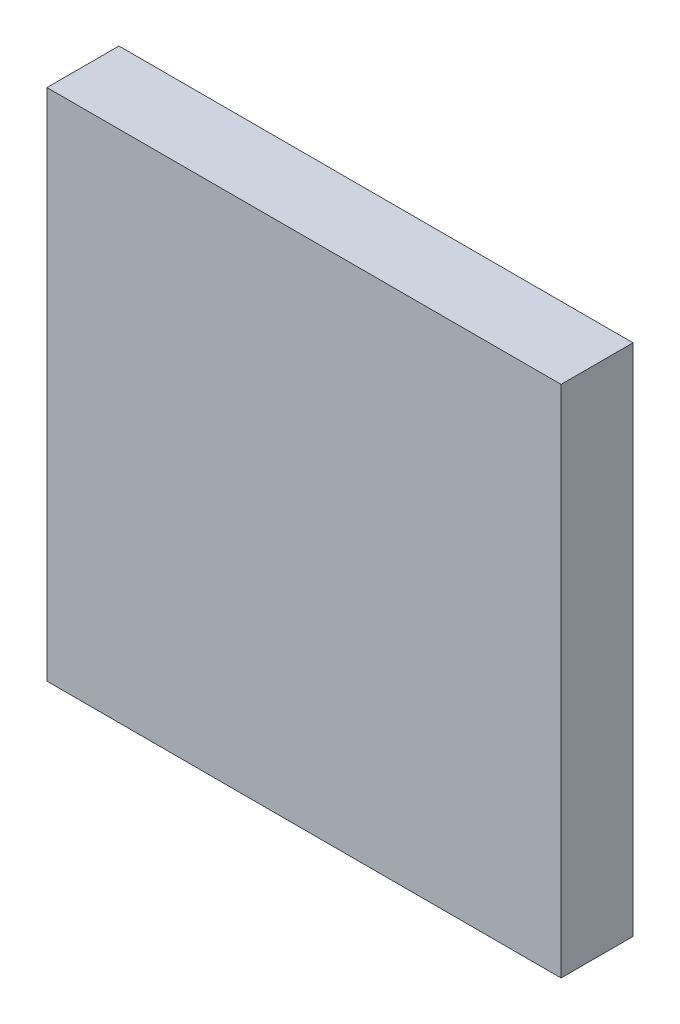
ISO-10303-21;
HEADER;
FILE_DESCRIPTION(('STEP AP214'),'2;1');
FILE_NAME('part.step','',(''),(''),'','','');
FILE_SCHEMA(('AUTOMOTIVE_DESIGN { 1 0 10303 214 1 1 1 1 }'));
ENDSEC;
DATA;
#1=APPLICATION_CONTEXT('core data for automotive mechanical design processes');
#2=APPLICATION_PROTOCOL_DEFINITION('international standard','automotive_design',2000,#1);
#3=PRODUCT_CONTEXT('',#1,'mechanical');
#4=PRODUCT('Part','Part','',(#3));
#5=PRODUCT_RELATED_PRODUCT_CATEGORY('part','',(#4));
#6=PRODUCT_DEFINITION_FORMATION('','',#4);
#7=PRODUCT_DEFINITION_CONTEXT('part definition',#1,'design');
#8=PRODUCT_DEFINITION('design','',#6,#7);
#9=PRODUCT_DEFINITION_SHAPE('','',#8);
#10=(LENGTH_UNIT() NAMED_UNIT(*) SI_UNIT(.MILLI.,.METRE.));
#11=(NAMED_UNIT(*) PLANE_ANGLE_UNIT() SI_UNIT($,.RADIAN.));
#12=(NAMED_UNIT(*) SI_UNIT($,.STERADIAN.) SOLID_ANGLE_UNIT());
#13=UNCERTAINTY_MEASURE_WITH_UNIT(LENGTH_MEASURE(1.E-05),#10,'distance_accuracy_value','');
#14=(GEOMETRIC_REPRESENTATION_CONTEXT(3) GLOBAL_UNCERTAINTY_ASSIGNED_CONTEXT((#13)) GLOBAL_UNIT_ASSIGNED_CONTEXT((#10,
#11,#12)) REPRESENTATION_CONTEXT('',''));
#15=CARTESIAN_POINT('',(0.,0.,0.));
#16=DIRECTION('',(0.,0.,1.));
#17=DIRECTION('',(1.,0.,0.));
#18=AXIS2_PLACEMENT_3D('',#15,#16,#17);
#19=CARTESIAN_POINT('',(-2.50000008,2.50000008,0.70000114));
#20=DIRECTION('',(0.,0.,1.));
#21=DIRECTION('',(1.,0.,0.));
#22=AXIS2_PLACEMENT_3D('',#19,#20,#21);
#23=PLANE('',#22);
#24=DIRECTION('',(0.,1.,0.));
#25=VECTOR('',#24,1.);
#26=CARTESIAN_POINT('',(2.50000008,2.50000008,0.70000114));
#27=LINE('',#26,#25);
#28=CARTESIAN_POINT('',(2.50000008,2.50000008,0.70000114));
#29=VERTEX_POINT('',#28);
#30=CARTESIAN_POINT('',(2.50000008,-2.50000008,0.70000114));
#31=VERTEX_POINT('',#30);
#32=EDGE_CURVE('E52',#29,#31,#27,.F.);
#33=ORIENTED_EDGE('',*,*,#32,.F.);
#34=DIRECTION('',(1.,0.,0.));
#35=VECTOR('',#34,1.);
#36=CARTESIAN_POINT('',(-2.50000008,2.50000008,0.70000114));
#37=LINE('',#36,#35);
#38=CARTESIAN_POINT('',(-2.50000008,2.50000008,0.70000114));
#39=VERTEX_POINT('',#38);
#40=EDGE_CURVE('E67',#39,#29,#37,.T.);
#41=ORIENTED_EDGE('',*,*,#40,.F.);
#42=DIRECTION('',(0.,1.,0.));
#43=VECTOR('',#42,1.);
#44=CARTESIAN_POINT('',(-2.50000008,-2.50000008,0.70000114));
#45=LINE('',#44,#43);
#46=CARTESIAN_POINT('',(-2.50000008,-2.50000008,0.70000114));
#47=VERTEX_POINT('',#46);
#48=EDGE_CURVE('E19',#47,#39,#45,.T.);
#49=ORIENTED_EDGE('',*,*,#48,.F.);
#50=DIRECTION('',(1.,0.,0.));
#51=VECTOR('',#50,1.);
#52=CARTESIAN_POINT('',(2.50000008,-2.50000008,0.70000114));
#53=LINE('',#52,#51);
#54=EDGE_CURVE('E57',#31,#47,#53,.F.);
#55=ORIENTED_EDGE('',*,*,#54,.F.);
#56=EDGE_LOOP('',(#33,#41,#49,#55));
#57=FACE_BOUND('',#56,.T.);
#58=ADVANCED_FACE('F16',(#57),#23,.T.);
#59=CARTESIAN_POINT('',(-2.50000008,-2.50000008,0.));
#60=DIRECTION('',(-1.,0.,0.));
#61=DIRECTION('',(0.,0.,1.));
#62=AXIS2_PLACEMENT_3D('',#59,#60,#61);
#63=PLANE('',#62);
#64=DIRECTION('',(0.,0.,1.));
#65=VECTOR('',#64,1.);
#66=CARTESIAN_POINT('',(-2.50000008,2.50000008,0.));
#67=LINE('',#66,#65);
#68=CARTESIAN_POINT('',(-2.50000008,2.50000008,0.));
#69=VERTEX_POINT('',#68);
#70=EDGE_CURVE('E78',#69,#39,#67,.T.);
#71=ORIENTED_EDGE('',*,*,#70,.F.);
#72=DIRECTION('',(0.,1.,0.));
#73=VECTOR('',#72,1.);
#74=CARTESIAN_POINT('',(-2.50000008,2.50000008,0.));
#75=LINE('',#74,#73);
#76=CARTESIAN_POINT('',(-2.50000008,-2.50000008,0.));
#77=VERTEX_POINT('',#76);
#78=EDGE_CURVE('E73',#69,#77,#75,.F.);
#79=ORIENTED_EDGE('',*,*,#78,.T.);
#80=DIRECTION('',(0.,0.,-1.));
#81=VECTOR('',#80,1.);
#82=CARTESIAN_POINT('',(-2.50000008,-2.50000008,0.));
#83=LINE('',#82,#81);
#84=EDGE_CURVE('E62',#47,#77,#83,.T.);
#85=ORIENTED_EDGE('',*,*,#84,.F.);
#86=ORIENTED_EDGE('',*,*,#48,.T.);
#87=EDGE_LOOP('',(#71,#79,#85,#86));
#88=FACE_BOUND('',#87,.T.);
#89=ADVANCED_FACE('F72',(#88),#63,.T.);
#90=CARTESIAN_POINT('',(2.50000008,-2.50000008,0.));
#91=DIRECTION('',(0.,-1.,0.));
#92=DIRECTION('',(0.,0.,-1.));
#93=AXIS2_PLACEMENT_3D('',#90,#91,#92);
#94=PLANE('',#93);
#95=ORIENTED_EDGE('',*,*,#84,.T.);
#96=DIRECTION('',(1.,0.,0.));
#97=VECTOR('',#96,1.);
#98=CARTESIAN_POINT('',(-2.50000008,-2.50000008,0.));
#99=LINE('',#98,#97);
#100=CARTESIAN_POINT('',(2.50000008,-2.50000008,0.));
#101=VERTEX_POINT('',#100);
#102=EDGE_CURVE('E83',#77,#101,#99,.T.);
#103=ORIENTED_EDGE('',*,*,#102,.T.);
#104=DIRECTION('',(0.,0.,-1.));
#105=VECTOR('',#104,1.);
#106=CARTESIAN_POINT('',(2.50000008,-2.50000008,0.));
#107=LINE('',#106,#105);
#108=EDGE_CURVE('E64',#31,#101,#107,.T.);
#109=ORIENTED_EDGE('',*,*,#108,.F.);
#110=ORIENTED_EDGE('',*,*,#54,.T.);
#111=EDGE_LOOP('',(#95,#103,#109,#110));
#112=FACE_BOUND('',#111,.T.);
#113=ADVANCED_FACE('F59',(#112),#94,.T.);
#114=CARTESIAN_POINT('',(2.50000008,2.50000008,0.));
#115=DIRECTION('',(1.,0.,0.));
#116=DIRECTION('',(0.,0.,-1.));
#117=AXIS2_PLACEMENT_3D('',#114,#115,#116);
#118=PLANE('',#117);
#119=ORIENTED_EDGE('',*,*,#108,.T.);
#120=DIRECTION('',(0.,1.,0.));
#121=VECTOR('',#120,1.);
#122=CARTESIAN_POINT('',(2.50000008,2.50000008,0.));
#123=LINE('',#122,#121);
#124=CARTESIAN_POINT('',(2.50000008,2.50000008,0.));
#125=VERTEX_POINT('',#124);
#126=EDGE_CURVE('E25',#101,#125,#123,.T.);
#127=ORIENTED_EDGE('',*,*,#126,.T.);
#128=DIRECTION('',(0.,0.,1.));
#129=VECTOR('',#128,1.);
#130=CARTESIAN_POINT('',(2.50000008,2.50000008,0.));
#131=LINE('',#130,#129);
#132=EDGE_CURVE('E33',#29,#125,#131,.F.);
#133=ORIENTED_EDGE('',*,*,#132,.F.);
#134=ORIENTED_EDGE('',*,*,#32,.T.);
#135=EDGE_LOOP('',(#119,#127,#133,#134));
#136=FACE_BOUND('',#135,.T.);
#137=ADVANCED_FACE('F87',(#136),#118,.T.);
#138=CARTESIAN_POINT('',(-2.50000008,2.50000008,0.));
#139=DIRECTION('',(0.,1.,0.));
#140=DIRECTION('',(0.,0.,1.));
#141=AXIS2_PLACEMENT_3D('',#138,#139,#140);
#142=PLANE('',#141);
#143=ORIENTED_EDGE('',*,*,#132,.T.);
#144=DIRECTION('',(1.,0.,0.));
#145=VECTOR('',#144,1.);
#146=CARTESIAN_POINT('',(-2.50000008,2.50000008,0.));
#147=LINE('',#146,#145);
#148=EDGE_CURVE('E11',#125,#69,#147,.F.);
#149=ORIENTED_EDGE('',*,*,#148,.T.);
#150=ORIENTED_EDGE('',*,*,#70,.T.);
#151=ORIENTED_EDGE('',*,*,#40,.T.);
#152=EDGE_LOOP('',(#143,#149,#150,#151));
#153=FACE_BOUND('',#152,.T.);
#154=ADVANCED_FACE('F90',(#153),#142,.T.);
#155=CARTESIAN_POINT('',(-2.50000008,2.50000008,0.));
#156=DIRECTION('',(0.,0.,1.));
#157=DIRECTION('',(1.,0.,0.));
#158=AXIS2_PLACEMENT_3D('',#155,#156,#157);
#159=PLANE('',#158);
#160=ORIENTED_EDGE('',*,*,#126,.F.);
#161=ORIENTED_EDGE('',*,*,#102,.F.);
#162=ORIENTED_EDGE('',*,*,#78,.F.);
#163=ORIENTED_EDGE('',*,*,#148,.F.);
#164=EDGE_LOOP('',(#160,#161,#162,#163));
#165=FACE_BOUND('',#164,.T.);
#166=ADVANCED_FACE('F89',(#165),#159,.F.);
#167=CLOSED_SHELL('',(#58,#89,#113,#137,#154,#166));
#168=MANIFOLD_SOLID_BREP('B1',#167);
#169=ADVANCED_BREP_SHAPE_REPRESENTATION('',(#18,#168),#14);
#170=SHAPE_DEFINITION_REPRESENTATION(#9,#169);
ENDSEC;
END-ISO-10303-21;
